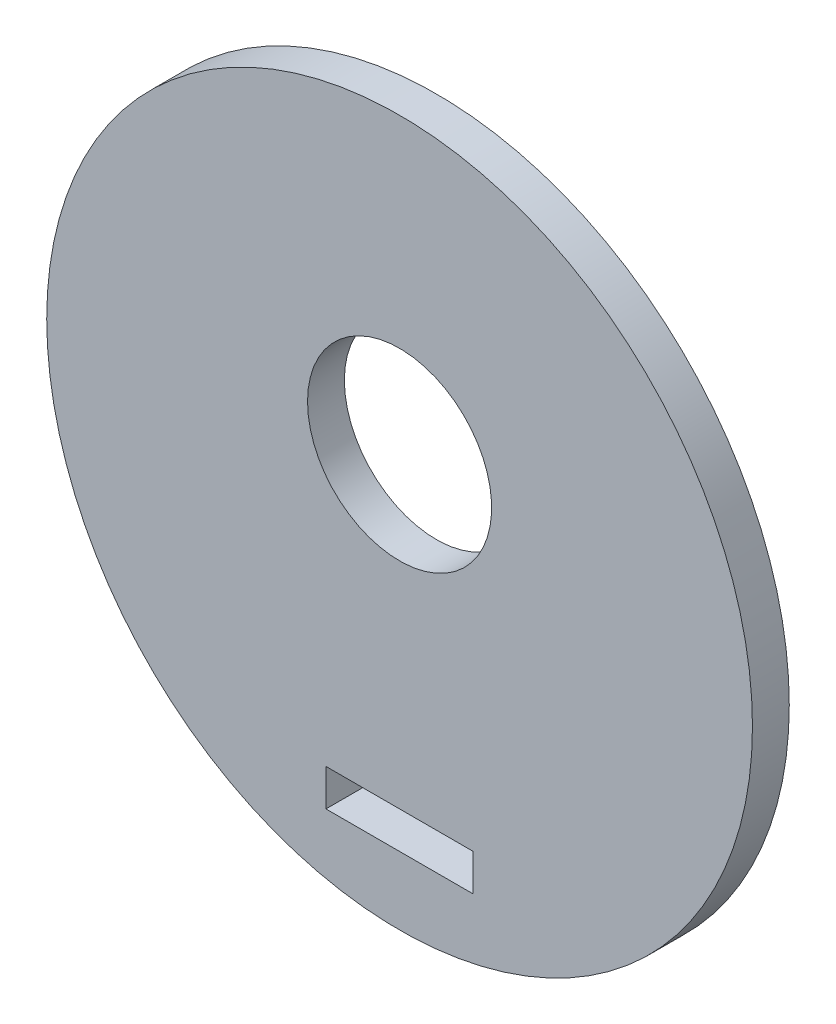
from build123d import *

# Parameters (mm, degrees)
SKETCH1_R          = 36.5125
EXTRUDE1_DEPTH     = 3.81
SKETCH2_R          = 9.525
CUT_EXTRUDE2_DEPTH = 52.776842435
SKETCH3_W          = 15.24
SKETCH3_H          = 3.81
CUT_EXTRUDE3_DEPTH = 52.776842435


with BuildPart() as part:
    # Sketch1 → Extrude1 (new body)
    with BuildSketch(Plane.XY):
        with Locations(Location((0, 0, 0), (0, 0, 180))):
            Circle(SKETCH1_R)
    extrude(amount=EXTRUDE1_DEPTH)

    # Sketch2 → Cut-Extrude2 (cut, through all)
    with BuildSketch(Plane.XY):
        with Locations(Location((0, 6.096, 0), (0, 0, 180))):
            Circle(SKETCH2_R)
    extrude(amount=CUT_EXTRUDE2_DEPTH, mode=Mode.SUBTRACT)

    # Sketch3 → Cut-Extrude3 (cut, through all)
    with BuildSketch(Plane.XY):
        with Locations((0, -27.559)):
            Rectangle(SKETCH3_W, SKETCH3_H)
    extrude(amount=CUT_EXTRUDE3_DEPTH, mode=Mode.SUBTRACT)


solid = part.part
